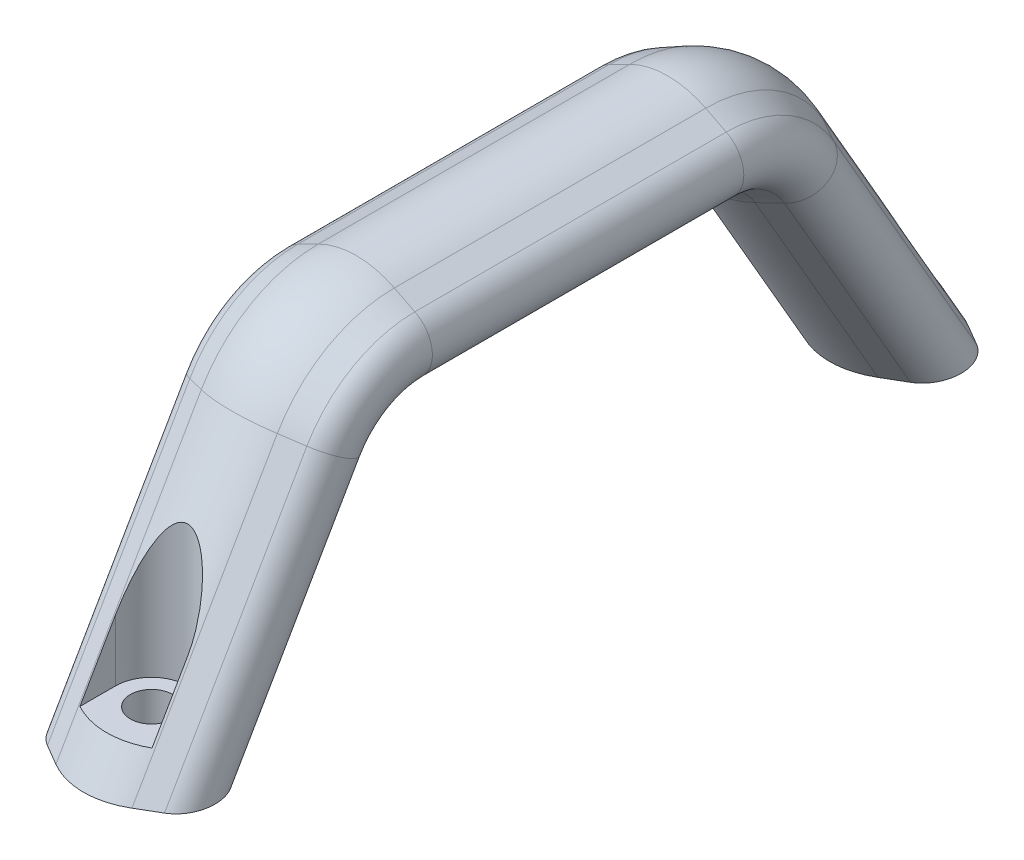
from build123d import *

# Parameters (mm, degrees)
SKETCH3_W          = 19
SKETCH3_H          = 107
CUT_EXTRUDE1_DEPTH = 69.069817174
SKETCH5_W          = 8.5
SKETCH5_H          = 24
CUT_EXTRUDE2_DEPTH = 4.5


with BuildPart() as part:
    # Sweep1: sweep along a path in Sketch2
    with BuildLine(Plane(origin=(0, 0, 0), x_dir=(0, 0, -1), z_dir=(1, 0, 0))) as sweep1_path:
        Line((-48.303847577, -3), (-29.828638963, 29))
        ThreePointArc((-29.828638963, 29), (-25.436334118, 33.392304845), (-19.436334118, 35))
        Line((-19.436334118, 35), (19.436334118, 35))
        ThreePointArc((19.436334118, 35), (25.436334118, 33.392304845), (29.828638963, 29))
        Line((29.828638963, 29), (48.303847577, -3))
    # Sketch1 → Sweep1 (sweep)
    with BuildSketch(Plane(origin=(0, 26.75, 99.832359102), x_dir=(1, 0, 0), z_dir=(0, -0.866025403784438, 0.500000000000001))):
        with BuildLine():
            Line((-7.307899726, -55.931877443), (-4.745736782, -54.633678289))
            ThreePointArc((-4.745736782, -54.633678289), (0, -53.5), (4.745736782, -54.633678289))
            Line((4.745736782, -54.633678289), (7.307899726, -55.931877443))
            ThreePointArc((7.307899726, -55.931877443), (9.5, -59.5), (7.307899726, -63.068122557))
            Line((7.307899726, -63.068122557), (4.745736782, -64.366321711))
            ThreePointArc((4.745736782, -64.366321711), (0, -65.5), (-4.745736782, -64.366321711))
            Line((-4.745736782, -64.366321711), (-7.307899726, -63.068122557))
            ThreePointArc((-7.307899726, -63.068122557), (-9.5, -59.5), (-7.307899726, -55.931877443))
        make_face()
    sweep(path=sweep1_path.line)

    # Sketch3 → Cut-Extrude1 (cut, through all)
    with BuildSketch(Plane(origin=(0, 0, 0), x_dir=(1, 0, 0), z_dir=(0, 1, 0))):
        Rectangle(SKETCH3_W, SKETCH3_H)
    extrude(amount=-CUT_EXTRUDE1_DEPTH, mode=Mode.SUBTRACT)

    # Sketch4 → Cut-Revolve1 (revolve, cut)
    with BuildSketch(Plane(origin=(0, 0, 0), x_dir=(0, 0, -1), z_dir=(1, 0, 0)), mode=Mode.PRIVATE) as cut_revolve1_sk:
        Polygon((45, 41), (49.5, 41), (49.5, 5), (47.65, 5), (47.65, 0), (45, 0), align=None)
    cut_revolve1 = revolve(cut_revolve1_sk.sketch.rotate(Axis((0, 41, -45), (0, -1, 0)), 180), axis=Axis((0, 41, -45), (0, -1, 0)), mode=Mode.SUBTRACT)

    # Sketch5 → Cut-Extrude2 (cut, symmetric)
    with BuildSketch(Plane(origin=(0, 0, 0), x_dir=(0, 0, -1), z_dir=(1, 0, 0))):
        with Locations((49.25, 17)):
            Rectangle(SKETCH5_W, SKETCH5_H)
    cut_extrude2 = extrude(amount=CUT_EXTRUDE2_DEPTH, both=True, mode=Mode.SUBTRACT)

    # Mirror1: Cut-Revolve1, Cut-Extrude2 across plane
    add(cut_revolve1.mirror(Plane.XY), mode=Mode.SUBTRACT)
    add(cut_extrude2.mirror(Plane.XY), mode=Mode.SUBTRACT)


solid = part.part
